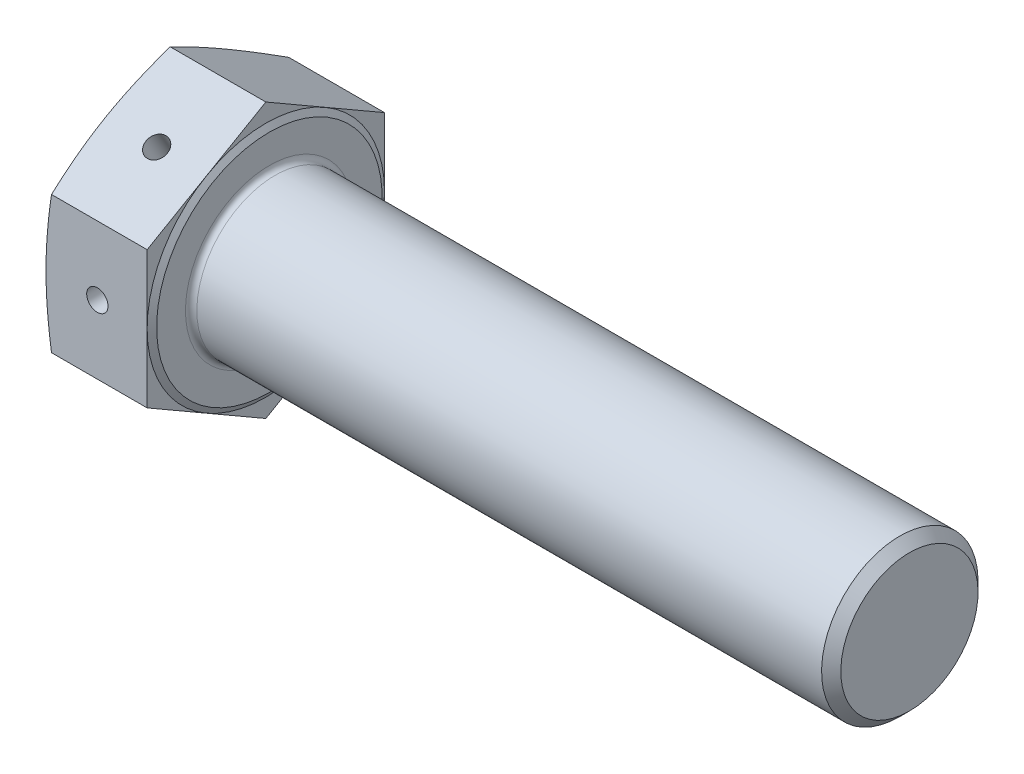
ISO-10303-21;
HEADER;
FILE_DESCRIPTION(('STEP AP214'),'2;1');
FILE_NAME('part.step','',(''),(''),'','','');
FILE_SCHEMA(('AUTOMOTIVE_DESIGN { 1 0 10303 214 1 1 1 1 }'));
ENDSEC;
DATA;
#1=APPLICATION_CONTEXT('core data for automotive mechanical design processes');
#2=APPLICATION_PROTOCOL_DEFINITION('international standard','automotive_design',2000,#1);
#3=PRODUCT_CONTEXT('',#1,'mechanical');
#4=PRODUCT('Part','Part','',(#3));
#5=PRODUCT_RELATED_PRODUCT_CATEGORY('part','',(#4));
#6=PRODUCT_DEFINITION_FORMATION('','',#4);
#7=PRODUCT_DEFINITION_CONTEXT('part definition',#1,'design');
#8=PRODUCT_DEFINITION('design','',#6,#7);
#9=PRODUCT_DEFINITION_SHAPE('','',#8);
#10=(LENGTH_UNIT() NAMED_UNIT(*) SI_UNIT(.MILLI.,.METRE.));
#11=(NAMED_UNIT(*) PLANE_ANGLE_UNIT() SI_UNIT($,.RADIAN.));
#12=(NAMED_UNIT(*) SI_UNIT($,.STERADIAN.) SOLID_ANGLE_UNIT());
#13=UNCERTAINTY_MEASURE_WITH_UNIT(LENGTH_MEASURE(1.E-05),#10,'distance_accuracy_value','');
#14=(GEOMETRIC_REPRESENTATION_CONTEXT(3) GLOBAL_UNCERTAINTY_ASSIGNED_CONTEXT((#13)) GLOBAL_UNIT_ASSIGNED_CONTEXT((#10,
#11,#12)) REPRESENTATION_CONTEXT('',''));
#15=CARTESIAN_POINT('',(0.,0.,0.));
#16=DIRECTION('',(0.,0.,1.));
#17=DIRECTION('',(1.,0.,0.));
#18=AXIS2_PLACEMENT_3D('',#15,#16,#17);
#19=CARTESIAN_POINT('',(7.22,0.,-16.69));
#20=DIRECTION('',(0.,0.,1.));
#21=DIRECTION('',(1.,0.,0.));
#22=AXIS2_PLACEMENT_3D('',#19,#20,#21);
#23=CYLINDRICAL_SURFACE('',#22,1.5);
#24=CARTESIAN_POINT('',(7.22,0.,16.69));
#25=DIRECTION('',(0.,0.,1.));
#26=DIRECTION('',(1.,0.,0.));
#27=AXIS2_PLACEMENT_3D('',#24,#25,#26);
#28=CIRCLE('',#27,1.5);
#29=CARTESIAN_POINT('',(8.72,0.,16.69));
#30=VERTEX_POINT('',#29);
#31=EDGE_CURVE('E584',#30,#30,#28,.T.);
#32=ORIENTED_EDGE('',*,*,#31,.T.);
#33=EDGE_LOOP('',(#32));
#34=FACE_BOUND('',#33,.T.);
#35=CARTESIAN_POINT('',(7.22,0.,0.));
#36=DIRECTION('',(0.,-0.866025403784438,0.500000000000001));
#37=DIRECTION('',(0.,0.500000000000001,0.866025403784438));
#38=AXIS2_PLACEMENT_3D('',#35,#36,#37);
#39=ELLIPSE('',#38,2.99999999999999,1.5);
#40=CARTESIAN_POINT('',(5.72,0.,0.));
#41=VERTEX_POINT('',#40);
#42=CARTESIAN_POINT('',(8.72,0.,0.));
#43=VERTEX_POINT('',#42);
#44=EDGE_CURVE('E46',#41,#43,#39,.F.);
#45=ORIENTED_EDGE('',*,*,#44,.T.);
#46=CARTESIAN_POINT('',(7.22,0.,0.));
#47=DIRECTION('',(0.,0.500000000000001,0.866025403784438));
#48=DIRECTION('',(0.,-0.866025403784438,0.500000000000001));
#49=AXIS2_PLACEMENT_3D('',#46,#47,#48);
#50=ELLIPSE('',#49,1.73205080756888,1.5);
#51=EDGE_CURVE('E11',#43,#41,#50,.F.);
#52=ORIENTED_EDGE('',*,*,#51,.T.);
#53=EDGE_LOOP('',(#45,#52));
#54=FACE_BOUND('',#53,.T.);
#55=ADVANCED_FACE('F32',(#34,#54),#23,.F.);
#56=CARTESIAN_POINT('',(14.72,0.,0.));
#57=DIRECTION('',(-1.,0.,0.));
#58=DIRECTION('',(0.,-1.,0.));
#59=AXIS2_PLACEMENT_3D('',#56,#57,#58);
#60=PLANE('',#59);
#61=CARTESIAN_POINT('',(14.72,0.,0.));
#62=DIRECTION('',(-1.,0.,0.));
#63=DIRECTION('',(0.,-1.,0.));
#64=AXIS2_PLACEMENT_3D('',#61,#62,#63);
#65=CIRCLE('',#64,11.8);
#66=CARTESIAN_POINT('',(14.72,-11.8,0.));
#67=VERTEX_POINT('',#66);
#68=EDGE_CURVE('E137',#67,#67,#65,.T.);
#69=ORIENTED_EDGE('',*,*,#68,.T.);
#70=EDGE_LOOP('',(#69));
#71=FACE_BOUND('',#70,.T.);
#72=CARTESIAN_POINT('',(14.72,0.,0.));
#73=DIRECTION('',(-1.,0.,0.));
#74=DIRECTION('',(0.,-1.,0.));
#75=AXIS2_PLACEMENT_3D('',#72,#73,#74);
#76=CIRCLE('',#75,15.855);
#77=CARTESIAN_POINT('',(14.72,-15.855,0.));
#78=VERTEX_POINT('',#77);
#79=EDGE_CURVE('E286',#78,#78,#76,.T.);
#80=ORIENTED_EDGE('',*,*,#79,.F.);
#81=EDGE_LOOP('',(#80));
#82=FACE_BOUND('',#81,.T.);
#83=ADVANCED_FACE('F240',(#71,#82),#60,.F.);
#84=CARTESIAN_POINT('',(14.22,0.,33.38));
#85=DIRECTION('',(-1.,0.,0.));
#86=DIRECTION('',(0.,0.,1.));
#87=AXIS2_PLACEMENT_3D('',#84,#85,#86);
#88=PLANE('',#87);
#89=DIRECTION('',(0.,-0.5,-0.866025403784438));
#90=VECTOR('',#89,1.);
#91=CARTESIAN_POINT('',(14.22,-9.63597599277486,16.69));
#92=LINE('',#91,#90);
#93=CARTESIAN_POINT('',(14.22,-9.63597599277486,16.69));
#94=VERTEX_POINT('',#93);
#95=CARTESIAN_POINT('',(14.22,-14.4539639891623,8.34500000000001));
#96=VERTEX_POINT('',#95);
#97=EDGE_CURVE('E198',#94,#96,#92,.T.);
#98=ORIENTED_EDGE('',*,*,#97,.T.);
#99=CARTESIAN_POINT('',(14.22,0.,0.));
#100=DIRECTION('',(-1.,0.,0.));
#101=DIRECTION('',(0.,-1.,0.));
#102=AXIS2_PLACEMENT_3D('',#99,#100,#101);
#103=CIRCLE('',#102,16.69);
#104=CARTESIAN_POINT('',(14.22,0.,16.69));
#105=VERTEX_POINT('',#104);
#106=EDGE_CURVE('E54',#96,#105,#103,.T.);
#107=ORIENTED_EDGE('',*,*,#106,.T.);
#108=DIRECTION('',(0.,-1.,0.));
#109=VECTOR('',#108,1.);
#110=CARTESIAN_POINT('',(14.22,9.63597599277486,16.69));
#111=LINE('',#110,#109);
#112=EDGE_CURVE('E181',#105,#94,#111,.T.);
#113=ORIENTED_EDGE('',*,*,#112,.T.);
#114=EDGE_LOOP('',(#98,#107,#113));
#115=FACE_BOUND('',#114,.T.);
#116=ADVANCED_FACE('F246',(#115),#88,.F.);
#117=CARTESIAN_POINT('',(14.22,9.63597599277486,16.69));
#118=VERTEX_POINT('',#117);
#119=EDGE_CURVE('E178',#118,#105,#111,.T.);
#120=ORIENTED_EDGE('',*,*,#119,.T.);
#121=CARTESIAN_POINT('',(14.22,14.4539639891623,8.345));
#122=VERTEX_POINT('',#121);
#123=EDGE_CURVE('E153',#105,#122,#103,.T.);
#124=ORIENTED_EDGE('',*,*,#123,.T.);
#125=DIRECTION('',(0.,-0.5,0.866025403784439));
#126=VECTOR('',#125,1.);
#127=CARTESIAN_POINT('',(14.22,19.2719519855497,0.));
#128=LINE('',#127,#126);
#129=EDGE_CURVE('E185',#122,#118,#128,.T.);
#130=ORIENTED_EDGE('',*,*,#129,.T.);
#131=EDGE_LOOP('',(#120,#124,#130));
#132=FACE_BOUND('',#131,.T.);
#133=ADVANCED_FACE('F342',(#132),#88,.F.);
#134=CARTESIAN_POINT('',(14.22,19.2719519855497,0.));
#135=VERTEX_POINT('',#134);
#136=EDGE_CURVE('E182',#135,#122,#128,.T.);
#137=ORIENTED_EDGE('',*,*,#136,.T.);
#138=CARTESIAN_POINT('',(14.22,14.4539639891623,-8.345));
#139=VERTEX_POINT('',#138);
#140=EDGE_CURVE('E347',#122,#139,#103,.T.);
#141=ORIENTED_EDGE('',*,*,#140,.T.);
#142=DIRECTION('',(0.,0.5,0.866025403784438));
#143=VECTOR('',#142,1.);
#144=CARTESIAN_POINT('',(14.22,9.63597599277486,-16.69));
#145=LINE('',#144,#143);
#146=EDGE_CURVE('E189',#139,#135,#145,.T.);
#147=ORIENTED_EDGE('',*,*,#146,.T.);
#148=EDGE_LOOP('',(#137,#141,#147));
#149=FACE_BOUND('',#148,.T.);
#150=ADVANCED_FACE('F346',(#149),#88,.F.);
#151=CARTESIAN_POINT('',(14.22,9.63597599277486,-16.69));
#152=VERTEX_POINT('',#151);
#153=EDGE_CURVE('E186',#152,#139,#145,.T.);
#154=ORIENTED_EDGE('',*,*,#153,.T.);
#155=CARTESIAN_POINT('',(14.22,0.,-16.69));
#156=VERTEX_POINT('',#155);
#157=EDGE_CURVE('E418',#139,#156,#103,.T.);
#158=ORIENTED_EDGE('',*,*,#157,.T.);
#159=DIRECTION('',(0.,1.,0.));
#160=VECTOR('',#159,1.);
#161=CARTESIAN_POINT('',(14.22,-9.63597599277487,-16.69));
#162=LINE('',#161,#160);
#163=EDGE_CURVE('E193',#156,#152,#162,.T.);
#164=ORIENTED_EDGE('',*,*,#163,.T.);
#165=EDGE_LOOP('',(#154,#158,#164));
#166=FACE_BOUND('',#165,.T.);
#167=ADVANCED_FACE('F405',(#166),#88,.F.);
#168=CARTESIAN_POINT('',(14.22,-9.63597599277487,-16.69));
#169=VERTEX_POINT('',#168);
#170=EDGE_CURVE('E190',#169,#156,#162,.T.);
#171=ORIENTED_EDGE('',*,*,#170,.T.);
#172=CARTESIAN_POINT('',(14.22,-14.4539639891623,-8.345));
#173=VERTEX_POINT('',#172);
#174=EDGE_CURVE('E413',#156,#173,#103,.T.);
#175=ORIENTED_EDGE('',*,*,#174,.T.);
#176=DIRECTION('',(0.,0.5,-0.866025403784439));
#177=VECTOR('',#176,1.);
#178=CARTESIAN_POINT('',(14.22,-19.2719519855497,0.));
#179=LINE('',#178,#177);
#180=EDGE_CURVE('E197',#173,#169,#179,.T.);
#181=ORIENTED_EDGE('',*,*,#180,.T.);
#182=EDGE_LOOP('',(#171,#175,#181));
#183=FACE_BOUND('',#182,.T.);
#184=ADVANCED_FACE('F235',(#183),#88,.F.);
#185=CARTESIAN_POINT('',(14.22,-9.63597599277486,16.69));
#186=DIRECTION('',(0.,0.866025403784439,-0.5));
#187=DIRECTION('',(0.,0.5,0.866025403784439));
#188=AXIS2_PLACEMENT_3D('',#185,#186,#187);
#189=PLANE('',#188);
#190=CARTESIAN_POINT('',(0.774166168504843,-19.2720674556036,-0.000199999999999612));
#191=CARTESIAN_POINT('',(0.71422314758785,-19.0721331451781,0.346096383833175));
#192=CARTESIAN_POINT('',(0.657011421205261,-18.8719946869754,0.692746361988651));
#193=CARTESIAN_POINT('',(0.548625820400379,-18.471297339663,1.38677452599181));
#194=CARTESIAN_POINT('',(0.497452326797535,-18.2707384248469,1.73415275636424));
#195=CARTESIAN_POINT('',(0.353819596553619,-17.6682682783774,2.77766166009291));
#196=CARTESIAN_POINT('',(0.271303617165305,-17.2657452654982,3.47485196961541));
#197=CARTESIAN_POINT('',(0.137661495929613,-16.4619940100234,4.86698998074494));
#198=CARTESIAN_POINT('',(0.0863363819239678,-16.0607741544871,5.56192315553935));
#199=CARTESIAN_POINT('',(0.0175097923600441,-15.2576907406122,6.95290443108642));
#200=CARTESIAN_POINT('',(0.,-14.8558273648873,7.64895221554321));
#201=CARTESIAN_POINT('',(0.,-14.0521006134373,9.04104778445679));
#202=CARTESIAN_POINT('',(0.0175097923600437,-13.6502372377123,9.73709556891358));
#203=CARTESIAN_POINT('',(0.0863363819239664,-12.8471538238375,11.1280768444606));
#204=CARTESIAN_POINT('',(0.13766149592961,-12.4459339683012,11.8230100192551));
#205=CARTESIAN_POINT('',(0.271303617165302,-11.6421827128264,13.2151480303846));
#206=CARTESIAN_POINT('',(0.353819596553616,-11.2396596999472,13.9123383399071));
#207=CARTESIAN_POINT('',(0.497452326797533,-10.6371895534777,14.9558472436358));
#208=CARTESIAN_POINT('',(0.548625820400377,-10.4366306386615,15.3032254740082));
#209=CARTESIAN_POINT('',(0.657011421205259,-10.0359332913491,15.9972536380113));
#210=CARTESIAN_POINT('',(0.714223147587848,-9.83579483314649,16.3439036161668));
#211=CARTESIAN_POINT('',(0.774166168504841,-9.63586052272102,16.6902));
#212=B_SPLINE_CURVE_WITH_KNOTS('',3,(#190,#191,#192,#193,#194,#195,#196,#197,#198,#199,#200,
#201,#202,#203,#204,#205,#206,#207,#208,#209,#210,#211),.UNSPECIFIED.,.F.,.F.,(4,2,2,2,2,2,2,2,
2,2,4),(0.,1.21299328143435,2.42606302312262,4.85330438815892,7.26489480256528,9.67589201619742,
12.0868892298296,14.4984796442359,16.9257210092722,18.1387907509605,19.3517840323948),.UNSPECIFIED.);
#213=CARTESIAN_POINT('',(0.774131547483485,-19.2719519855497,0.));
#214=VERTEX_POINT('',#213);
#215=CARTESIAN_POINT('',(0.,-14.4539639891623,8.34500000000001));
#216=VERTEX_POINT('',#215);
#217=EDGE_CURVE('E357',#214,#216,#212,.T.);
#218=ORIENTED_EDGE('',*,*,#217,.F.);
#219=DIRECTION('',(-1.,0.,0.));
#220=VECTOR('',#219,1.);
#221=CARTESIAN_POINT('',(14.22,-19.2719519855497,0.));
#222=LINE('',#221,#220);
#223=CARTESIAN_POINT('',(14.22,-19.2719519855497,0.));
#224=VERTEX_POINT('',#223);
#225=EDGE_CURVE('E160',#224,#214,#222,.T.);
#226=ORIENTED_EDGE('',*,*,#225,.F.);
#227=EDGE_CURVE('E201',#96,#224,#92,.T.);
#228=ORIENTED_EDGE('',*,*,#227,.F.);
#229=ORIENTED_EDGE('',*,*,#97,.F.);
#230=DIRECTION('',(-1.,0.,0.));
#231=VECTOR('',#230,1.);
#232=CARTESIAN_POINT('',(14.22,-9.63597599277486,16.69));
#233=LINE('',#232,#231);
#234=CARTESIAN_POINT('',(0.774131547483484,-9.63597599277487,16.69));
#235=VERTEX_POINT('',#234);
#236=EDGE_CURVE('E175',#94,#235,#233,.T.);
#237=ORIENTED_EDGE('',*,*,#236,.T.);
#238=EDGE_CURVE('E334',#216,#235,#212,.T.);
#239=ORIENTED_EDGE('',*,*,#238,.F.);
#240=EDGE_LOOP('',(#218,#226,#228,#229,#237,#239));
#241=FACE_BOUND('',#240,.T.);
#242=ADVANCED_FACE('F34',(#241),#189,.F.);
#243=CARTESIAN_POINT('',(14.22,-19.2719519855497,0.));
#244=DIRECTION('',(0.,0.866025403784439,0.5));
#245=DIRECTION('',(0.,-0.5,0.866025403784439));
#246=AXIS2_PLACEMENT_3D('',#243,#244,#245);
#247=PLANE('',#246);
#248=CARTESIAN_POINT('',(7.22,-14.4539639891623,-8.34499999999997));
#249=DIRECTION('',(0.,0.866025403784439,0.5));
#250=DIRECTION('',(0.,-0.5,0.866025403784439));
#251=AXIS2_PLACEMENT_3D('',#248,#249,#250);
#252=CIRCLE('',#251,1.5);
#253=CARTESIAN_POINT('',(7.22,-15.2039639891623,-7.04596189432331));
#254=VERTEX_POINT('',#253);
#255=EDGE_CURVE('E582',#254,#254,#252,.T.);
#256=ORIENTED_EDGE('',*,*,#255,.T.);
#257=EDGE_LOOP('',(#256));
#258=FACE_BOUND('',#257,.T.);
#259=CARTESIAN_POINT('',(0.774166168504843,-9.63586052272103,-16.6902));
#260=CARTESIAN_POINT('',(0.71422314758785,-9.83579483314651,-16.3439036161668));
#261=CARTESIAN_POINT('',(0.657011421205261,-10.0359332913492,-15.9972536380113));
#262=CARTESIAN_POINT('',(0.548625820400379,-10.4366306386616,-15.3032254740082));
#263=CARTESIAN_POINT('',(0.497452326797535,-10.6371895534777,-14.9558472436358));
#264=CARTESIAN_POINT('',(0.353819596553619,-11.2396596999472,-13.9123383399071));
#265=CARTESIAN_POINT('',(0.271303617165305,-11.6421827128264,-13.2151480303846));
#266=CARTESIAN_POINT('',(0.137661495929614,-12.4459339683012,-11.8230100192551));
#267=CARTESIAN_POINT('',(0.086336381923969,-12.8471538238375,-11.1280768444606));
#268=CARTESIAN_POINT('',(0.0175097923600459,-13.6502372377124,-9.73709556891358));
#269=CARTESIAN_POINT('',(0.,-14.0521006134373,-9.04104778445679));
#270=CARTESIAN_POINT('',(0.,-14.8558273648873,-7.64895221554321));
#271=CARTESIAN_POINT('',(0.0175097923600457,-15.2576907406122,-6.95290443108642));
#272=CARTESIAN_POINT('',(0.0863363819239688,-16.0607741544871,-5.56192315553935));
#273=CARTESIAN_POINT('',(0.137661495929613,-16.4619940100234,-4.86698998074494));
#274=CARTESIAN_POINT('',(0.271303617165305,-17.2657452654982,-3.47485196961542));
#275=CARTESIAN_POINT('',(0.353819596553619,-17.6682682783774,-2.77766166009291));
#276=CARTESIAN_POINT('',(0.497452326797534,-18.2707384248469,-1.73415275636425));
#277=CARTESIAN_POINT('',(0.548625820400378,-18.471297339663,-1.38677452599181));
#278=CARTESIAN_POINT('',(0.65701142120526,-18.8719946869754,-0.692746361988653));
#279=CARTESIAN_POINT('',(0.71422314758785,-19.0721331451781,-0.346096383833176));
#280=CARTESIAN_POINT('',(0.774166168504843,-19.2720674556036,0.000199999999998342));
#281=B_SPLINE_CURVE_WITH_KNOTS('',3,(#259,#260,#261,#262,#263,#264,#265,#266,#267,#268,#269,
#270,#271,#272,#273,#274,#275,#276,#277,#278,#279,#280),.UNSPECIFIED.,.F.,.F.,(4,2,2,2,2,2,2,2,
2,2,4),(0.,1.21299328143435,2.42606302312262,4.85330438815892,7.26489480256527,9.67589201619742,
12.0868892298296,14.4984796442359,16.9257210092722,18.1387907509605,19.3517840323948),.UNSPECIFIED.);
#282=CARTESIAN_POINT('',(0.774131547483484,-9.63597599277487,-16.69));
#283=VERTEX_POINT('',#282);
#284=CARTESIAN_POINT('',(0.,-14.4539639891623,-8.34499999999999));
#285=VERTEX_POINT('',#284);
#286=EDGE_CURVE('E356',#283,#285,#281,.T.);
#287=ORIENTED_EDGE('',*,*,#286,.F.);
#288=DIRECTION('',(-1.,0.,0.));
#289=VECTOR('',#288,1.);
#290=CARTESIAN_POINT('',(14.22,-9.63597599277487,-16.69));
#291=LINE('',#290,#289);
#292=EDGE_CURVE('E163',#169,#283,#291,.T.);
#293=ORIENTED_EDGE('',*,*,#292,.F.);
#294=ORIENTED_EDGE('',*,*,#180,.F.);
#295=EDGE_CURVE('E194',#224,#173,#179,.T.);
#296=ORIENTED_EDGE('',*,*,#295,.F.);
#297=ORIENTED_EDGE('',*,*,#225,.T.);
#298=EDGE_CURVE('E211',#285,#214,#281,.T.);
#299=ORIENTED_EDGE('',*,*,#298,.F.);
#300=EDGE_LOOP('',(#287,#293,#294,#296,#297,#299));
#301=FACE_BOUND('',#300,.T.);
#302=ADVANCED_FACE('F225',(#258,#301),#247,.F.);
#303=CARTESIAN_POINT('',(14.22,-9.63597599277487,-16.69));
#304=DIRECTION('',(0.,0.,1.));
#305=DIRECTION('',(0.,-1.,0.));
#306=AXIS2_PLACEMENT_3D('',#303,#304,#305);
#307=PLANE('',#306);
#308=CARTESIAN_POINT('',(7.22,0.,-16.69));
#309=DIRECTION('',(0.,0.,1.));
#310=DIRECTION('',(1.,0.,0.));
#311=AXIS2_PLACEMENT_3D('',#308,#309,#310);
#312=CIRCLE('',#311,1.5);
#313=CARTESIAN_POINT('',(8.72,0.,-16.69));
#314=VERTEX_POINT('',#313);
#315=EDGE_CURVE('E292',#314,#314,#312,.T.);
#316=ORIENTED_EDGE('',*,*,#315,.T.);
#317=EDGE_LOOP('',(#316));
#318=FACE_BOUND('',#317,.T.);
#319=CARTESIAN_POINT('',(4.13056238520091,-25.4884021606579,-16.69));
#320=CARTESIAN_POINT('',(4.03565085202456,-25.1100094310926,-16.69));
#321=CARTESIAN_POINT('',(3.94133217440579,-24.7314680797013,-16.69));
#322=CARTESIAN_POINT('',(3.75401163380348,-23.9740581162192,-16.69));
#323=CARTESIAN_POINT('',(3.66100977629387,-23.5951895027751,-16.69));
#324=CARTESIAN_POINT('',(3.3841680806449,-22.4580147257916,-16.69));
#325=CARTESIAN_POINT('',(3.20250159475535,-21.6991772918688,-16.69));
#326=CARTESIAN_POINT('',(2.84605698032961,-20.1788961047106,-16.69));
#327=CARTESIAN_POINT('',(2.67128761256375,-19.4174502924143,-16.69));
#328=CARTESIAN_POINT('',(2.33055763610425,-17.8925908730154,-16.69));
#329=CARTESIAN_POINT('',(2.16459693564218,-17.1291772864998,-16.69));
#330=CARTESIAN_POINT('',(1.8452376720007,-15.6077732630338,-16.69));
#331=CARTESIAN_POINT('',(1.69172905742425,-14.8498060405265,-16.69));
#332=CARTESIAN_POINT('',(1.39802253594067,-13.3312764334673,-16.69));
#333=CARTESIAN_POINT('',(1.25782468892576,-12.5707140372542,-16.69));
#334=CARTESIAN_POINT('',(0.993931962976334,-11.0468385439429,-16.69));
#335=CARTESIAN_POINT('',(0.870234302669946,-10.2835259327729,-16.69));
#336=CARTESIAN_POINT('',(0.643026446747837,-8.75386639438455,-16.69));
#337=CARTESIAN_POINT('',(0.539516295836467,-7.98751946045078,-16.69));
#338=CARTESIAN_POINT('',(0.355400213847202,-6.44074134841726,-16.69));
#339=CARTESIAN_POINT('',(0.275148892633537,-5.66026730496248,-16.69));
#340=CARTESIAN_POINT('',(0.143645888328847,-4.09685903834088,-16.69));
#341=CARTESIAN_POINT('',(0.0923933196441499,-3.31392489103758,-16.69));
#342=CARTESIAN_POINT('',(0.0219847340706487,-1.74704230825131,-16.69));
#343=CARTESIAN_POINT('',(0.00280999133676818,-0.963094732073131,-16.69));
#344=CARTESIAN_POINT('',(-0.00223381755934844,0.604909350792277,-16.69));
#345=CARTESIAN_POINT('',(0.0118970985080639,1.38896585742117,-16.69));
#346=CARTESIAN_POINT('',(0.0726630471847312,2.95937250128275,-16.69));
#347=CARTESIAN_POINT('',(0.119445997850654,3.74571679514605,-16.69));
#348=CARTESIAN_POINT('',(0.242785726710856,5.31604528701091,-16.69));
#349=CARTESIAN_POINT('',(0.31934338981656,6.10002941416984,-16.69));
#350=CARTESIAN_POINT('',(0.498291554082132,7.66567227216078,-16.69));
#351=CARTESIAN_POINT('',(0.600703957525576,8.44732846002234,-16.69));
#352=CARTESIAN_POINT('',(0.827028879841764,10.0074865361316,-16.69));
#353=CARTESIAN_POINT('',(0.950941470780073,10.7859884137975,-16.69));
#354=CARTESIAN_POINT('',(1.2066804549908,12.2837572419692,-16.69));
#355=CARTESIAN_POINT('',(1.33728570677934,13.0032348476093,-16.69));
#356=CARTESIAN_POINT('',(1.61082994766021,14.4398529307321,-16.69));
#357=CARTESIAN_POINT('',(1.75376934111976,15.1569933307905,-16.69));
#358=CARTESIAN_POINT('',(2.04971358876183,16.5892737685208,-16.69));
#359=CARTESIAN_POINT('',(2.20271964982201,17.3044135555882,-16.69));
#360=CARTESIAN_POINT('',(2.51692809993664,18.73287560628,-16.69));
#361=CARTESIAN_POINT('',(2.67813039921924,19.4461978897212,-16.69));
#362=CARTESIAN_POINT('',(3.00728624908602,20.871457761,-16.69));
#363=CARTESIAN_POINT('',(3.1752413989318,21.5833949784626,-16.69));
#364=CARTESIAN_POINT('',(3.5166808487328,23.0059408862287,-16.69));
#365=CARTESIAN_POINT('',(3.69016515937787,23.716549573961,-16.69));
#366=CARTESIAN_POINT('',(4.0417002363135,25.1365767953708,-16.69));
#367=CARTESIAN_POINT('',(4.21975065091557,25.8459954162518,-16.69));
#368=CARTESIAN_POINT('',(4.57967808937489,27.2638621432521,-16.69));
#369=CARTESIAN_POINT('',(4.76155512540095,27.9723102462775,-16.69));
#370=CARTESIAN_POINT('',(5.30745768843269,30.0789597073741,-16.69));
#371=CARTESIAN_POINT('',(5.67612060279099,31.4759592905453,-16.69));
#372=CARTESIAN_POINT('',(6.42244236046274,34.2675762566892,-16.69));
#373=CARTESIAN_POINT('',(6.80010140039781,35.6621935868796,-16.69));
#374=CARTESIAN_POINT('',(7.56156532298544,38.4476093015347,-16.69));
#375=CARTESIAN_POINT('',(7.94536066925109,39.8384102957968,-16.69));
#376=CARTESIAN_POINT('',(8.52485130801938,41.9235251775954,-16.69));
#377=CARTESIAN_POINT('',(8.71864402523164,42.6183690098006,-16.69));
#378=CARTESIAN_POINT('',(9.10735243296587,44.0077415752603,-16.69));
#379=CARTESIAN_POINT('',(9.30226812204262,44.7022703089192,-16.69));
#380=CARTESIAN_POINT('',(9.49767290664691,45.3966614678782,-16.69));
#381=B_SPLINE_CURVE_WITH_KNOTS('',3,(#319,#320,#321,#322,#323,#324,#325,#326,#327,#328,#329,
#330,#331,#332,#333,#334,#335,#336,#337,#338,#339,#340,#341,#342,#343,#344,#345,#346,#347,#348,
#349,#350,#351,#352,#353,#354,#355,#356,#357,#358,#359,#360,#361,#362,#363,#364,#365,#366,#367,
#368,#369,#370,#371,#372,#373,#374,#375,#376,#377,#378,#379,#380),.UNSPECIFIED.,.F.,.F.,(4,2,2,
2,2,2,2,2,2,2,2,2,2,2,2,2,2,2,2,2,2,2,2,2,2,2,2,2,2,2,4),(0.,1.17034234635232,2.34068955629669,
4.68150049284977,7.02519485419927,9.36886479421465,11.6888373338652,14.0088203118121,
16.3284117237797,18.648008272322,21.0013048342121,23.3545295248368,25.7063800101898,
28.0582292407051,30.4208024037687,32.7834457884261,35.1480973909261,37.5127569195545,
39.70633748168,41.8999899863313,44.0939059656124,46.2877979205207,48.4822125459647,
50.6766314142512,52.8708817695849,55.0651391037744,59.3995670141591,63.7340897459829,
68.062428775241,70.2265150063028,72.3905984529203),.UNSPECIFIED.);
#382=CARTESIAN_POINT('',(0.774131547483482,9.63597599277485,-16.69));
#383=VERTEX_POINT('',#382);
#384=CARTESIAN_POINT('',(0.,0.,-16.69));
#385=VERTEX_POINT('',#384);
#386=EDGE_CURVE('E209',#383,#385,#381,.F.);
#387=ORIENTED_EDGE('',*,*,#386,.F.);
#388=DIRECTION('',(-1.,0.,0.));
#389=VECTOR('',#388,1.);
#390=CARTESIAN_POINT('',(14.22,9.63597599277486,-16.69));
#391=LINE('',#390,#389);
#392=EDGE_CURVE('E166',#152,#383,#391,.T.);
#393=ORIENTED_EDGE('',*,*,#392,.F.);
#394=ORIENTED_EDGE('',*,*,#163,.F.);
#395=ORIENTED_EDGE('',*,*,#170,.F.);
#396=ORIENTED_EDGE('',*,*,#292,.T.);
#397=EDGE_CURVE('E202',#385,#283,#381,.F.);
#398=ORIENTED_EDGE('',*,*,#397,.F.);
#399=EDGE_LOOP('',(#387,#393,#394,#395,#396,#398));
#400=FACE_BOUND('',#399,.T.);
#401=ADVANCED_FACE('F220',(#318,#400),#307,.F.);
#402=CARTESIAN_POINT('',(14.22,9.63597599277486,-16.69));
#403=DIRECTION('',(0.,-0.866025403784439,0.5));
#404=DIRECTION('',(0.,-0.5,-0.866025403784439));
#405=AXIS2_PLACEMENT_3D('',#402,#403,#404);
#406=PLANE('',#405);
#407=CARTESIAN_POINT('',(0.774166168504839,19.2720674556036,0.000199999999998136));
#408=CARTESIAN_POINT('',(0.714223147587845,19.0721331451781,-0.346096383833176));
#409=CARTESIAN_POINT('',(0.657011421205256,18.8719946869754,-0.692746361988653));
#410=CARTESIAN_POINT('',(0.548625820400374,18.471297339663,-1.38677452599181));
#411=CARTESIAN_POINT('',(0.49745232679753,18.2707384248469,-1.73415275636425));
#412=CARTESIAN_POINT('',(0.353819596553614,17.6682682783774,-2.77766166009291));
#413=CARTESIAN_POINT('',(0.271303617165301,17.2657452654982,-3.47485196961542));
#414=CARTESIAN_POINT('',(0.137661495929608,16.4619940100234,-4.86698998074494));
#415=CARTESIAN_POINT('',(0.0863363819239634,16.0607741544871,-5.56192315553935));
#416=CARTESIAN_POINT('',(0.0175097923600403,15.2576907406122,-6.95290443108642));
#417=CARTESIAN_POINT('',(0.,14.8558273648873,-7.64895221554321));
#418=CARTESIAN_POINT('',(0.,14.0521006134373,-9.04104778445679));
#419=CARTESIAN_POINT('',(0.0175097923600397,13.6502372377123,-9.73709556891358));
#420=CARTESIAN_POINT('',(0.0863363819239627,12.8471538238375,-11.1280768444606));
#421=CARTESIAN_POINT('',(0.137661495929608,12.4459339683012,-11.8230100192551));
#422=CARTESIAN_POINT('',(0.271303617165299,11.6421827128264,-13.2151480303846));
#423=CARTESIAN_POINT('',(0.353819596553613,11.2396596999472,-13.9123383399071));
#424=CARTESIAN_POINT('',(0.497452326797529,10.6371895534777,-14.9558472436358));
#425=CARTESIAN_POINT('',(0.548625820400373,10.4366306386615,-15.3032254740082));
#426=CARTESIAN_POINT('',(0.657011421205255,10.0359332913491,-15.9972536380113));
#427=CARTESIAN_POINT('',(0.714223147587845,9.83579483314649,-16.3439036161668));
#428=CARTESIAN_POINT('',(0.774166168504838,9.63586052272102,-16.6902));
#429=B_SPLINE_CURVE_WITH_KNOTS('',3,(#407,#408,#409,#410,#411,#412,#413,#414,#415,#416,#417,
#418,#419,#420,#421,#422,#423,#424,#425,#426,#427,#428),.UNSPECIFIED.,.F.,.F.,(4,2,2,2,2,2,2,2,
2,2,4),(0.,1.21299328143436,2.42606302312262,4.85330438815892,7.26489480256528,9.67589201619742,
12.0868892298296,14.4984796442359,16.9257210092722,18.1387907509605,19.3517840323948),.UNSPECIFIED.);
#430=CARTESIAN_POINT('',(0.774131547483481,19.2719519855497,0.));
#431=VERTEX_POINT('',#430);
#432=CARTESIAN_POINT('',(0.,14.4539639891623,-8.345));
#433=VERTEX_POINT('',#432);
#434=EDGE_CURVE('E353',#431,#433,#429,.T.);
#435=ORIENTED_EDGE('',*,*,#434,.F.);
#436=DIRECTION('',(-1.,0.,0.));
#437=VECTOR('',#436,1.);
#438=CARTESIAN_POINT('',(14.22,19.2719519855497,0.));
#439=LINE('',#438,#437);
#440=EDGE_CURVE('E169',#135,#431,#439,.T.);
#441=ORIENTED_EDGE('',*,*,#440,.F.);
#442=ORIENTED_EDGE('',*,*,#146,.F.);
#443=ORIENTED_EDGE('',*,*,#153,.F.);
#444=ORIENTED_EDGE('',*,*,#392,.T.);
#445=EDGE_CURVE('E210',#433,#383,#429,.T.);
#446=ORIENTED_EDGE('',*,*,#445,.F.);
#447=EDGE_LOOP('',(#435,#441,#442,#443,#444,#446));
#448=FACE_BOUND('',#447,.T.);
#449=ADVANCED_FACE('F224',(#448),#406,.F.);
#450=CARTESIAN_POINT('',(14.22,19.2719519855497,0.));
#451=DIRECTION('',(0.,-0.866025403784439,-0.5));
#452=DIRECTION('',(0.,0.5,-0.866025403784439));
#453=AXIS2_PLACEMENT_3D('',#450,#451,#452);
#454=PLANE('',#453);
#455=CARTESIAN_POINT('',(7.22,14.4539639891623,8.34499999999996));
#456=DIRECTION('',(0.,-0.866025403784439,-0.5));
#457=DIRECTION('',(0.,0.5,-0.866025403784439));
#458=AXIS2_PLACEMENT_3D('',#455,#456,#457);
#459=CIRCLE('',#458,1.5);
#460=CARTESIAN_POINT('',(7.22,15.2039639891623,7.04596189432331));
#461=VERTEX_POINT('',#460);
#462=EDGE_CURVE('E324',#461,#461,#459,.T.);
#463=ORIENTED_EDGE('',*,*,#462,.T.);
#464=EDGE_LOOP('',(#463));
#465=FACE_BOUND('',#464,.T.);
#466=CARTESIAN_POINT('',(0.774166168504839,9.63586052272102,16.6902));
#467=CARTESIAN_POINT('',(0.714223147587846,9.8357948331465,16.3439036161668));
#468=CARTESIAN_POINT('',(0.657011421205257,10.0359332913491,15.9972536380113));
#469=CARTESIAN_POINT('',(0.548625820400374,10.4366306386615,15.3032254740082));
#470=CARTESIAN_POINT('',(0.49745232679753,10.6371895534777,14.9558472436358));
#471=CARTESIAN_POINT('',(0.353819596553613,11.2396596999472,13.9123383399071));
#472=CARTESIAN_POINT('',(0.2713036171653,11.6421827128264,13.2151480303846));
#473=CARTESIAN_POINT('',(0.137661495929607,12.4459339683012,11.8230100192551));
#474=CARTESIAN_POINT('',(0.086336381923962,12.8471538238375,11.1280768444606));
#475=CARTESIAN_POINT('',(0.0175097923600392,13.6502372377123,9.73709556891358));
#476=CARTESIAN_POINT('',(0.,14.0521006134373,9.04104778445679));
#477=CARTESIAN_POINT('',(0.,14.8558273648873,7.64895221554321));
#478=CARTESIAN_POINT('',(0.0175097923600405,15.2576907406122,6.95290443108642));
#479=CARTESIAN_POINT('',(0.0863363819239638,16.0607741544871,5.56192315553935));
#480=CARTESIAN_POINT('',(0.137661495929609,16.4619940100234,4.86698998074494));
#481=CARTESIAN_POINT('',(0.271303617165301,17.2657452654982,3.47485196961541));
#482=CARTESIAN_POINT('',(0.353819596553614,17.6682682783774,2.7776616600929));
#483=CARTESIAN_POINT('',(0.497452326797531,18.2707384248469,1.73415275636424));
#484=CARTESIAN_POINT('',(0.548625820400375,18.471297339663,1.3867745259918));
#485=CARTESIAN_POINT('',(0.657011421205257,18.8719946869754,0.692746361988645));
#486=CARTESIAN_POINT('',(0.714223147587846,19.0721331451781,0.346096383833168));
#487=CARTESIAN_POINT('',(0.774166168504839,19.2720674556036,-0.00020000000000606));
#488=B_SPLINE_CURVE_WITH_KNOTS('',3,(#466,#467,#468,#469,#470,#471,#472,#473,#474,#475,#476,
#477,#478,#479,#480,#481,#482,#483,#484,#485,#486,#487),.UNSPECIFIED.,.F.,.F.,(4,2,2,2,2,2,2,2,
2,2,4),(0.,1.21299328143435,2.42606302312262,4.85330438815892,7.26489480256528,9.67589201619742,
12.0868892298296,14.4984796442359,16.9257210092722,18.1387907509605,19.3517840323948),.UNSPECIFIED.);
#489=CARTESIAN_POINT('',(0.774131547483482,9.63597599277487,16.69));
#490=VERTEX_POINT('',#489);
#491=CARTESIAN_POINT('',(0.,14.4539639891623,8.34500000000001));
#492=VERTEX_POINT('',#491);
#493=EDGE_CURVE('E302',#490,#492,#488,.T.);
#494=ORIENTED_EDGE('',*,*,#493,.F.);
#495=DIRECTION('',(-1.,0.,0.));
#496=VECTOR('',#495,1.);
#497=CARTESIAN_POINT('',(14.22,9.63597599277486,16.69));
#498=LINE('',#497,#496);
#499=EDGE_CURVE('E172',#118,#490,#498,.T.);
#500=ORIENTED_EDGE('',*,*,#499,.F.);
#501=ORIENTED_EDGE('',*,*,#129,.F.);
#502=ORIENTED_EDGE('',*,*,#136,.F.);
#503=ORIENTED_EDGE('',*,*,#440,.T.);
#504=EDGE_CURVE('E330',#492,#431,#488,.T.);
#505=ORIENTED_EDGE('',*,*,#504,.F.);
#506=EDGE_LOOP('',(#494,#500,#501,#502,#503,#505));
#507=FACE_BOUND('',#506,.T.);
#508=ADVANCED_FACE('F312',(#465,#507),#454,.F.);
#509=CARTESIAN_POINT('',(14.22,9.63597599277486,16.69));
#510=DIRECTION('',(0.,0.,-1.));
#511=DIRECTION('',(0.,1.,0.));
#512=AXIS2_PLACEMENT_3D('',#509,#510,#511);
#513=PLANE('',#512);
#514=ORIENTED_EDGE('',*,*,#31,.F.);
#515=EDGE_LOOP('',(#514));
#516=FACE_BOUND('',#515,.T.);
#517=CARTESIAN_POINT('',(4.13056185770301,-25.4884000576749,16.69));
#518=CARTESIAN_POINT('',(4.03565033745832,-25.110007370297,16.69));
#519=CARTESIAN_POINT('',(3.94133167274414,-24.7314660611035,16.69));
#520=CARTESIAN_POINT('',(3.75401115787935,-23.9740561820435,16.69));
#521=CARTESIAN_POINT('',(3.66100931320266,-23.5951876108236,16.69));
#522=CARTESIAN_POINT('',(3.38416765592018,-22.4580129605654,16.69));
#523=CARTESIAN_POINT('',(3.20250119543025,-21.6991756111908,16.69));
#524=CARTESIAN_POINT('',(2.84605663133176,-20.1788945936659,16.69));
#525=CARTESIAN_POINT('',(2.6712872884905,-19.4174488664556,16.69));
#526=CARTESIAN_POINT('',(2.3305573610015,-17.8925896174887,16.69));
#527=CARTESIAN_POINT('',(2.16459668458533,-17.1291761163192,16.69));
#528=CARTESIAN_POINT('',(1.84523746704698,-15.607772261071,16.69));
#529=CARTESIAN_POINT('',(1.69172887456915,-14.8498051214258,16.69));
#530=CARTESIAN_POINT('',(1.3980223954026,-13.3312756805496,16.69));
#531=CARTESIAN_POINT('',(1.25782456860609,-12.5707133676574,16.69));
#532=CARTESIAN_POINT('',(0.993931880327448,-11.0468380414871,16.69));
#533=CARTESIAN_POINT('',(0.870234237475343,-10.2835255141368,16.69));
#534=CARTESIAN_POINT('',(0.643026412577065,-8.75386614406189,16.69));
#535=CARTESIAN_POINT('',(0.539516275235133,-7.98751929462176,16.69));
#536=CARTESIAN_POINT('',(0.3554002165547,-6.44074136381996,16.69));
#537=CARTESIAN_POINT('',(0.275148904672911,-5.66026741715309,16.69));
#538=CARTESIAN_POINT('',(0.143645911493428,-4.09685934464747,16.69));
#539=CARTESIAN_POINT('',(0.0923933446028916,-3.31392529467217,16.69));
#540=CARTESIAN_POINT('',(0.0219847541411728,-1.74704290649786,16.69));
#541=CARTESIAN_POINT('',(0.00281000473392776,-0.963095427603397,16.69));
#542=CARTESIAN_POINT('',(-0.00223382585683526,0.60490846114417,16.69));
#543=CARTESIAN_POINT('',(0.0118970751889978,1.38896487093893,16.69));
#544=CARTESIAN_POINT('',(0.072662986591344,2.95937132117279,16.69));
#545=CARTESIAN_POINT('',(0.119445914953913,3.74571551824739,16.69));
#546=CARTESIAN_POINT('',(0.242785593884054,5.3160438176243,16.69));
#547=CARTESIAN_POINT('',(0.319343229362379,6.10002784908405,16.69));
#548=CARTESIAN_POINT('',(0.498291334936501,7.66567051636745,16.69));
#549=CARTESIAN_POINT('',(0.600703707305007,8.44732660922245,16.69));
#550=CARTESIAN_POINT('',(0.827028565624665,10.0074844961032,16.69));
#551=CARTESIAN_POINT('',(0.950941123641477,10.7859862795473,16.69));
#552=CARTESIAN_POINT('',(1.20668005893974,12.2837550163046,16.69));
#553=CARTESIAN_POINT('',(1.3372852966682,13.0032326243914,16.69));
#554=CARTESIAN_POINT('',(1.610829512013,14.4398507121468,16.69));
#555=CARTESIAN_POINT('',(1.75376889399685,15.1569911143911,16.69));
#556=CARTESIAN_POINT('',(2.04971312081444,16.5892715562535,16.69));
#557=CARTESIAN_POINT('',(2.20271917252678,17.3044113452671,16.69));
#558=CARTESIAN_POINT('',(2.51692760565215,18.7328733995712,16.69));
#559=CARTESIAN_POINT('',(2.67812989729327,19.4461956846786,16.69));
#560=CARTESIAN_POINT('',(3.00728573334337,20.8714555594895,16.69));
#561=CARTESIAN_POINT('',(3.17524087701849,21.5833927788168,16.69));
#562=CARTESIAN_POINT('',(3.51668031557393,23.005938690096,16.69));
#563=CARTESIAN_POINT('',(3.69016462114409,23.7165473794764,16.69));
#564=CARTESIAN_POINT('',(4.04169968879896,25.1365746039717,16.69));
#565=CARTESIAN_POINT('',(4.21975009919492,25.8459932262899,16.69));
#566=CARTESIAN_POINT('',(4.5796775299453,27.2638599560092,16.69));
#567=CARTESIAN_POINT('',(4.76155456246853,27.9723080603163,16.69));
#568=CARTESIAN_POINT('',(5.30745711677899,30.0789575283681,16.69));
#569=CARTESIAN_POINT('',(5.67612002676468,31.4759571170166,16.69));
#570=CARTESIAN_POINT('',(6.42244177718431,34.26757409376,16.69));
#571=CARTESIAN_POINT('',(6.80010081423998,35.6621914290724,16.69));
#572=CARTESIAN_POINT('',(7.56156473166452,38.4476071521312,16.69));
#573=CARTESIAN_POINT('',(7.94536007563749,39.8384081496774,16.69));
#574=CARTESIAN_POINT('',(8.52485071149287,41.9235230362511,16.69));
#575=CARTESIAN_POINT('',(8.71864342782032,42.6183668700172,16.69));
#576=CARTESIAN_POINT('',(9.10735183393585,44.0077394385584,16.69));
#577=CARTESIAN_POINT('',(9.30226752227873,44.7022681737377,16.69));
#578=CARTESIAN_POINT('',(9.49767230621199,45.3966593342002,16.69));
#579=B_SPLINE_CURVE_WITH_KNOTS('',3,(#517,#518,#519,#520,#521,#522,#523,#524,#525,#526,#527,
#528,#529,#530,#531,#532,#533,#534,#535,#536,#537,#538,#539,#540,#541,#542,#543,#544,#545,#546,
#547,#548,#549,#550,#551,#552,#553,#554,#555,#556,#557,#558,#559,#560,#561,#562,#563,#564,#565,
#566,#567,#568,#569,#570,#571,#572,#573,#574,#575,#576,#577,#578),.UNSPECIFIED.,.F.,.F.,(4,2,2,
2,2,2,2,2,2,2,2,2,2,2,2,2,2,2,2,2,2,2,2,2,2,2,2,2,2,2,4),(0.,1.17034221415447,2.3406892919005,
4.68149996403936,7.02519405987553,9.36886373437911,11.6888360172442,14.0088187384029,
16.3284098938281,18.6480061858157,21.001302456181,23.3545268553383,25.7063770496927,
28.0582259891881,30.4207988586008,32.7834419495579,35.1480932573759,37.5127524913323,
39.7063330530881,41.8999855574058,44.0939015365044,46.2877934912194,48.4822081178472,
50.6766269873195,52.8708773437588,55.0651346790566,59.3995626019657,63.7340853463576,
68.0624243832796,70.2265106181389,72.3905940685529),.UNSPECIFIED.);
#580=CARTESIAN_POINT('',(0.,0.,16.69));
#581=VERTEX_POINT('',#580);
#582=EDGE_CURVE('E301',#235,#581,#579,.T.);
#583=ORIENTED_EDGE('',*,*,#582,.F.);
#584=ORIENTED_EDGE('',*,*,#236,.F.);
#585=ORIENTED_EDGE('',*,*,#112,.F.);
#586=ORIENTED_EDGE('',*,*,#119,.F.);
#587=ORIENTED_EDGE('',*,*,#499,.T.);
#588=EDGE_CURVE('E290',#581,#490,#579,.T.);
#589=ORIENTED_EDGE('',*,*,#588,.F.);
#590=EDGE_LOOP('',(#583,#584,#585,#586,#587,#589));
#591=FACE_BOUND('',#590,.T.);
#592=ADVANCED_FACE('F307',(#516,#591),#513,.F.);
#593=ORIENTED_EDGE('',*,*,#295,.T.);
#594=EDGE_CURVE('E157',#173,#96,#103,.T.);
#595=ORIENTED_EDGE('',*,*,#594,.T.);
#596=ORIENTED_EDGE('',*,*,#227,.T.);
#597=EDGE_LOOP('',(#593,#595,#596));
#598=FACE_BOUND('',#597,.T.);
#599=ADVANCED_FACE('F311',(#598),#88,.F.);
#600=CARTESIAN_POINT('',(0.,0.,0.));
#601=DIRECTION('',(1.,0.,0.));
#602=DIRECTION('',(0.,1.,0.));
#603=AXIS2_PLACEMENT_3D('',#600,#601,#602);
#604=CONICAL_SURFACE('',#603,16.69,1.27950087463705);
#605=ORIENTED_EDGE('',*,*,#238,.T.);
#606=ORIENTED_EDGE('',*,*,#582,.T.);
#607=CARTESIAN_POINT('',(0.,0.,0.));
#608=DIRECTION('',(-1.,0.,0.));
#609=DIRECTION('',(0.,-1.,0.));
#610=AXIS2_PLACEMENT_3D('',#607,#608,#609);
#611=CIRCLE('',#610,16.69);
#612=EDGE_CURVE('E288',#216,#581,#611,.T.);
#613=ORIENTED_EDGE('',*,*,#612,.F.);
#614=EDGE_LOOP('',(#605,#606,#613));
#615=FACE_BOUND('',#614,.T.);
#616=ADVANCED_FACE('F392',(#615),#604,.T.);
#617=ORIENTED_EDGE('',*,*,#298,.T.);
#618=ORIENTED_EDGE('',*,*,#217,.T.);
#619=CARTESIAN_POINT('',(0.,0.,0.));
#620=DIRECTION('',(-1.,0.,0.));
#621=DIRECTION('',(0.,0.,1.));
#622=AXIS2_PLACEMENT_3D('',#619,#620,#621);
#623=CIRCLE('',#622,16.69);
#624=EDGE_CURVE('E159',#285,#216,#623,.T.);
#625=ORIENTED_EDGE('',*,*,#624,.F.);
#626=EDGE_LOOP('',(#617,#618,#625));
#627=FACE_BOUND('',#626,.T.);
#628=ADVANCED_FACE('F376',(#627),#604,.T.);
#629=ORIENTED_EDGE('',*,*,#397,.T.);
#630=ORIENTED_EDGE('',*,*,#286,.T.);
#631=EDGE_CURVE('E369',#385,#285,#623,.T.);
#632=ORIENTED_EDGE('',*,*,#631,.F.);
#633=EDGE_LOOP('',(#629,#630,#632));
#634=FACE_BOUND('',#633,.T.);
#635=ADVANCED_FACE('F367',(#634),#604,.T.);
#636=ORIENTED_EDGE('',*,*,#386,.T.);
#637=EDGE_CURVE('E381',#433,#385,#623,.T.);
#638=ORIENTED_EDGE('',*,*,#637,.F.);
#639=ORIENTED_EDGE('',*,*,#445,.T.);
#640=EDGE_LOOP('',(#636,#638,#639));
#641=FACE_BOUND('',#640,.T.);
#642=ADVANCED_FACE('F216',(#641),#604,.T.);
#643=ORIENTED_EDGE('',*,*,#434,.T.);
#644=EDGE_CURVE('E158',#492,#433,#623,.T.);
#645=ORIENTED_EDGE('',*,*,#644,.F.);
#646=ORIENTED_EDGE('',*,*,#504,.T.);
#647=EDGE_LOOP('',(#643,#645,#646));
#648=FACE_BOUND('',#647,.T.);
#649=ADVANCED_FACE('F403',(#648),#604,.T.);
#650=ORIENTED_EDGE('',*,*,#493,.T.);
#651=EDGE_CURVE('E154',#581,#492,#623,.T.);
#652=ORIENTED_EDGE('',*,*,#651,.F.);
#653=ORIENTED_EDGE('',*,*,#588,.T.);
#654=EDGE_LOOP('',(#650,#652,#653));
#655=FACE_BOUND('',#654,.T.);
#656=ADVANCED_FACE('F281',(#655),#604,.T.);
#657=CARTESIAN_POINT('',(0.,0.,33.38));
#658=DIRECTION('',(-1.,0.,0.));
#659=DIRECTION('',(0.,0.,1.));
#660=AXIS2_PLACEMENT_3D('',#657,#658,#659);
#661=PLANE('',#660);
#662=ORIENTED_EDGE('',*,*,#612,.T.);
#663=ORIENTED_EDGE('',*,*,#651,.T.);
#664=ORIENTED_EDGE('',*,*,#644,.T.);
#665=ORIENTED_EDGE('',*,*,#637,.T.);
#666=ORIENTED_EDGE('',*,*,#631,.T.);
#667=ORIENTED_EDGE('',*,*,#624,.T.);
#668=EDGE_LOOP('',(#662,#663,#664,#665,#666,#667));
#669=FACE_BOUND('',#668,.T.);
#670=ADVANCED_FACE('F277',(#669),#661,.T.);
#671=CARTESIAN_POINT('',(14.72,0.,0.));
#672=DIRECTION('',(-1.,0.,0.));
#673=DIRECTION('',(0.,-1.,0.));
#674=AXIS2_PLACEMENT_3D('',#671,#672,#673);
#675=CONICAL_SURFACE('',#674,15.855,1.03125788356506);
#676=ORIENTED_EDGE('',*,*,#106,.F.);
#677=ORIENTED_EDGE('',*,*,#594,.F.);
#678=ORIENTED_EDGE('',*,*,#174,.F.);
#679=ORIENTED_EDGE('',*,*,#157,.F.);
#680=ORIENTED_EDGE('',*,*,#140,.F.);
#681=ORIENTED_EDGE('',*,*,#123,.F.);
#682=EDGE_LOOP('',(#676,#677,#678,#679,#680,#681));
#683=FACE_BOUND('',#682,.T.);
#684=ORIENTED_EDGE('',*,*,#79,.T.);
#685=EDGE_LOOP('',(#684));
#686=FACE_BOUND('',#685,.T.);
#687=ADVANCED_FACE('F274',(#683,#686),#675,.T.);
#688=CARTESIAN_POINT('',(104.72,0.,0.));
#689=DIRECTION('',(-1.,0.,0.));
#690=DIRECTION('',(0.,-1.,0.));
#691=AXIS2_PLACEMENT_3D('',#688,#689,#690);
#692=CYLINDRICAL_SURFACE('',#691,11.);
#693=CARTESIAN_POINT('',(15.52,0.,0.));
#694=DIRECTION('',(-1.,0.,0.));
#695=DIRECTION('',(0.,-1.,0.));
#696=AXIS2_PLACEMENT_3D('',#693,#694,#695);
#697=CIRCLE('',#696,11.);
#698=CARTESIAN_POINT('',(15.52,-11.,0.));
#699=VERTEX_POINT('',#698);
#700=EDGE_CURVE('E144',#699,#699,#697,.F.);
#701=CARTESIAN_POINT('',(103.367,0.,0.));
#702=DIRECTION('',(1.,0.,0.));
#703=DIRECTION('',(0.,1.,0.));
#704=AXIS2_PLACEMENT_3D('',#701,#702,#703);
#705=CIRCLE('',#704,11.);
#706=CARTESIAN_POINT('',(103.367,-11.,0.));
#707=VERTEX_POINT('',#706);
#708=EDGE_CURVE('E147',#707,#707,#705,.F.);
#709=CARTESIAN_POINT('',(15.52,-11.,0.));
#710=CARTESIAN_POINT('',(16.4350729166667,-11.,0.));
#711=CARTESIAN_POINT('',(17.3501458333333,-11.,0.));
#712=CARTESIAN_POINT('',(19.1802916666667,-11.,0.));
#713=CARTESIAN_POINT('',(20.0953645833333,-11.,0.));
#714=CARTESIAN_POINT('',(21.9255104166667,-11.,0.));
#715=CARTESIAN_POINT('',(22.8405833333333,-11.,0.));
#716=CARTESIAN_POINT('',(24.6707291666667,-11.,0.));
#717=CARTESIAN_POINT('',(25.5858020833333,-11.,0.));
#718=CARTESIAN_POINT('',(27.4159479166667,-11.,0.));
#719=CARTESIAN_POINT('',(28.3310208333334,-11.,0.));
#720=CARTESIAN_POINT('',(30.1611666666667,-11.,0.));
#721=CARTESIAN_POINT('',(31.0762395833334,-11.,0.));
#722=CARTESIAN_POINT('',(32.9063854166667,-11.,0.));
#723=CARTESIAN_POINT('',(33.8214583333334,-11.,0.));
#724=CARTESIAN_POINT('',(35.6516041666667,-11.,0.));
#725=CARTESIAN_POINT('',(36.5666770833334,-11.,0.));
#726=CARTESIAN_POINT('',(38.3968229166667,-11.,0.));
#727=CARTESIAN_POINT('',(39.3118958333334,-11.,0.));
#728=CARTESIAN_POINT('',(41.1420416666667,-11.,0.));
#729=CARTESIAN_POINT('',(42.0571145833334,-11.,0.));
#730=CARTESIAN_POINT('',(43.8872604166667,-11.,0.));
#731=CARTESIAN_POINT('',(44.8023333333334,-11.,0.));
#732=CARTESIAN_POINT('',(46.6324791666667,-11.,0.));
#733=CARTESIAN_POINT('',(47.5475520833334,-11.,0.));
#734=CARTESIAN_POINT('',(49.3776979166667,-11.,0.));
#735=CARTESIAN_POINT('',(50.2927708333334,-11.,0.));
#736=CARTESIAN_POINT('',(52.1229166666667,-11.,0.));
#737=CARTESIAN_POINT('',(53.0379895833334,-11.,0.));
#738=CARTESIAN_POINT('',(54.8681354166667,-11.,0.));
#739=CARTESIAN_POINT('',(55.7832083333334,-11.,0.));
#740=CARTESIAN_POINT('',(57.6133541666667,-11.,0.));
#741=CARTESIAN_POINT('',(58.5284270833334,-11.,0.));
#742=CARTESIAN_POINT('',(60.3585729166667,-11.,0.));
#743=CARTESIAN_POINT('',(61.2736458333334,-11.,0.));
#744=CARTESIAN_POINT('',(63.1037916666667,-11.,0.));
#745=CARTESIAN_POINT('',(64.0188645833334,-11.,0.));
#746=CARTESIAN_POINT('',(65.8490104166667,-11.,0.));
#747=CARTESIAN_POINT('',(66.7640833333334,-11.,0.));
#748=CARTESIAN_POINT('',(68.5942291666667,-11.,0.));
#749=CARTESIAN_POINT('',(69.5093020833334,-11.,0.));
#750=CARTESIAN_POINT('',(71.3394479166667,-11.,0.));
#751=CARTESIAN_POINT('',(72.2545208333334,-11.,0.));
#752=CARTESIAN_POINT('',(74.0846666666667,-11.,0.));
#753=CARTESIAN_POINT('',(74.9997395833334,-11.,0.));
#754=CARTESIAN_POINT('',(76.8298854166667,-11.,0.));
#755=CARTESIAN_POINT('',(77.7449583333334,-11.,0.));
#756=CARTESIAN_POINT('',(79.5751041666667,-11.,0.));
#757=CARTESIAN_POINT('',(80.4901770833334,-11.,0.));
#758=CARTESIAN_POINT('',(82.3203229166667,-11.,0.));
#759=CARTESIAN_POINT('',(83.2353958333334,-11.,0.));
#760=CARTESIAN_POINT('',(85.0655416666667,-11.,0.));
#761=CARTESIAN_POINT('',(85.9806145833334,-11.,0.));
#762=CARTESIAN_POINT('',(87.8107604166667,-11.,0.));
#763=CARTESIAN_POINT('',(88.7258333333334,-11.,0.));
#764=CARTESIAN_POINT('',(90.5559791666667,-11.,0.));
#765=CARTESIAN_POINT('',(91.4710520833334,-11.,0.));
#766=CARTESIAN_POINT('',(93.3011979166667,-11.,0.));
#767=CARTESIAN_POINT('',(94.2162708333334,-11.,0.));
#768=CARTESIAN_POINT('',(96.0464166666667,-11.,0.));
#769=CARTESIAN_POINT('',(96.9614895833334,-11.,0.));
#770=CARTESIAN_POINT('',(98.7916354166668,-11.,0.));
#771=CARTESIAN_POINT('',(99.7067083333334,-11.,0.));
#772=CARTESIAN_POINT('',(101.536854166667,-11.,0.));
#773=CARTESIAN_POINT('',(102.451927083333,-11.,0.));
#774=CARTESIAN_POINT('',(103.367,-11.,0.));
#775=B_SPLINE_CURVE_WITH_KNOTS('',3,(#709,#710,#711,#712,#713,#714,#715,#716,#717,#718,#719,
#720,#721,#722,#723,#724,#725,#726,#727,#728,#729,#730,#731,#732,#733,#734,#735,#736,#737,#738,
#739,#740,#741,#742,#743,#744,#745,#746,#747,#748,#749,#750,#751,#752,#753,#754,#755,#756,#757,
#758,#759,#760,#761,#762,#763,#764,#765,#766,#767,#768,#769,#770,#771,#772,#773,#774),
.UNSPECIFIED.,.F.,.F.,(4,2,2,2,2,2,2,2,2,2,2,2,2,2,2,2,2,2,2,2,2,2,2,2,2,2,2,2,2,2,2,2,4),(0.,
2.74521875,5.4904375,8.23565625,10.980875,13.72609375,16.4713125,19.21653125,21.96175,
24.70696875,27.4521875,30.19740625,32.942625,35.68784375,38.4330625,41.17828125,43.9235,
46.66871875,49.4139375,52.15915625,54.9043750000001,57.6495937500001,60.3948125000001,
63.14003125,65.88525,68.6304687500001,71.3756875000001,74.1209062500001,76.8661250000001,
79.6113437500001,82.3565625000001,85.1017812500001,87.8470000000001),.UNSPECIFIED.);
#776=EDGE_CURVE('BSEAM270',#699,#707,#775,.T.);
#777=ORIENTED_EDGE('',*,*,#700,.T.);
#778=ORIENTED_EDGE('',*,*,#708,.T.);
#779=ORIENTED_EDGE('',*,*,#776,.T.);
#780=ORIENTED_EDGE('',*,*,#776,.F.);
#781=EDGE_LOOP('',(#777,#779,#778,#780));
#782=FACE_BOUND('',#781,.T.);
#783=ADVANCED_FACE('F270',(#782),#692,.T.);
#784=CARTESIAN_POINT('',(104.72,0.,0.));
#785=DIRECTION('',(1.,0.,0.));
#786=DIRECTION('',(0.,1.,0.));
#787=AXIS2_PLACEMENT_3D('',#784,#785,#786);
#788=PLANE('',#787);
#789=CARTESIAN_POINT('',(104.72,0.,0.));
#790=DIRECTION('',(1.,0.,0.));
#791=DIRECTION('',(0.,1.,0.));
#792=AXIS2_PLACEMENT_3D('',#789,#790,#791);
#793=CIRCLE('',#792,9.6470000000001);
#794=CARTESIAN_POINT('',(104.72,-9.64700000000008,0.));
#795=VERTEX_POINT('',#794);
#796=EDGE_CURVE('E150',#795,#795,#793,.T.);
#797=ORIENTED_EDGE('',*,*,#796,.T.);
#798=EDGE_LOOP('',(#797));
#799=FACE_BOUND('',#798,.T.);
#800=ADVANCED_FACE('F262',(#799),#788,.T.);
#801=CARTESIAN_POINT('',(104.72,0.,0.));
#802=DIRECTION('',(-1.,0.,0.));
#803=DIRECTION('',(0.,-1.,0.));
#804=AXIS2_PLACEMENT_3D('',#801,#802,#803);
#805=CONICAL_SURFACE('',#804,9.6470000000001,0.785398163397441);
#806=CARTESIAN_POINT('',(103.367,-11.,0.));
#807=CARTESIAN_POINT('',(103.38109375,-10.98590625,0.));
#808=CARTESIAN_POINT('',(103.3951875,-10.9718125,0.));
#809=CARTESIAN_POINT('',(103.423375,-10.943625,0.));
#810=CARTESIAN_POINT('',(103.43746875,-10.92953125,0.));
#811=CARTESIAN_POINT('',(103.46565625,-10.90134375,0.));
#812=CARTESIAN_POINT('',(103.47975,-10.88725,0.));
#813=CARTESIAN_POINT('',(103.5079375,-10.8590625,0.));
#814=CARTESIAN_POINT('',(103.52203125,-10.84496875,0.));
#815=CARTESIAN_POINT('',(103.55021875,-10.81678125,0.));
#816=CARTESIAN_POINT('',(103.5643125,-10.8026875,0.));
#817=CARTESIAN_POINT('',(103.5925,-10.7745,0.));
#818=CARTESIAN_POINT('',(103.60659375,-10.76040625,0.));
#819=CARTESIAN_POINT('',(103.63478125,-10.73221875,0.));
#820=CARTESIAN_POINT('',(103.648875,-10.718125,0.));
#821=CARTESIAN_POINT('',(103.6770625,-10.6899375,0.));
#822=CARTESIAN_POINT('',(103.69115625,-10.67584375,0.));
#823=CARTESIAN_POINT('',(103.71934375,-10.64765625,0.));
#824=CARTESIAN_POINT('',(103.7334375,-10.6335625,0.));
#825=CARTESIAN_POINT('',(103.761625,-10.605375,0.));
#826=CARTESIAN_POINT('',(103.77571875,-10.59128125,0.));
#827=CARTESIAN_POINT('',(103.80390625,-10.56309375,0.));
#828=CARTESIAN_POINT('',(103.818,-10.549,0.));
#829=CARTESIAN_POINT('',(103.8461875,-10.5208125,0.));
#830=CARTESIAN_POINT('',(103.86028125,-10.50671875,0.));
#831=CARTESIAN_POINT('',(103.88846875,-10.47853125,0.));
#832=CARTESIAN_POINT('',(103.9025625,-10.4644375,0.));
#833=CARTESIAN_POINT('',(103.93075,-10.43625,0.));
#834=CARTESIAN_POINT('',(103.94484375,-10.42215625,0.));
#835=CARTESIAN_POINT('',(103.97303125,-10.39396875,0.));
#836=CARTESIAN_POINT('',(103.987125,-10.379875,0.));
#837=CARTESIAN_POINT('',(104.0153125,-10.3516875,0.));
#838=CARTESIAN_POINT('',(104.02940625,-10.33759375,0.));
#839=CARTESIAN_POINT('',(104.05759375,-10.30940625,0.));
#840=CARTESIAN_POINT('',(104.0716875,-10.2953125,0.));
#841=CARTESIAN_POINT('',(104.099875,-10.267125,0.));
#842=CARTESIAN_POINT('',(104.11396875,-10.25303125,0.));
#843=CARTESIAN_POINT('',(104.14215625,-10.22484375,0.));
#844=CARTESIAN_POINT('',(104.15625,-10.21075,0.));
#845=CARTESIAN_POINT('',(104.1844375,-10.1825625,0.));
#846=CARTESIAN_POINT('',(104.19853125,-10.16846875,0.));
#847=CARTESIAN_POINT('',(104.22671875,-10.14028125,0.));
#848=CARTESIAN_POINT('',(104.2408125,-10.1261875,0.));
#849=CARTESIAN_POINT('',(104.269,-10.098,0.));
#850=CARTESIAN_POINT('',(104.28309375,-10.08390625,0.));
#851=CARTESIAN_POINT('',(104.31128125,-10.05571875,0.));
#852=CARTESIAN_POINT('',(104.325375,-10.041625,0.));
#853=CARTESIAN_POINT('',(104.3535625,-10.0134375,0.));
#854=CARTESIAN_POINT('',(104.36765625,-9.99934375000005,0.));
#855=CARTESIAN_POINT('',(104.39584375,-9.97115625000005,0.));
#856=CARTESIAN_POINT('',(104.4099375,-9.95706250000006,0.));
#857=CARTESIAN_POINT('',(104.438125,-9.92887500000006,0.));
#858=CARTESIAN_POINT('',(104.45221875,-9.91478125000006,0.));
#859=CARTESIAN_POINT('',(104.48040625,-9.88659375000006,0.));
#860=CARTESIAN_POINT('',(104.4945,-9.87250000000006,0.));
#861=CARTESIAN_POINT('',(104.5226875,-9.84431250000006,0.));
#862=CARTESIAN_POINT('',(104.53678125,-9.83021875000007,0.));
#863=CARTESIAN_POINT('',(104.56496875,-9.80203125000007,0.));
#864=CARTESIAN_POINT('',(104.5790625,-9.78793750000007,0.));
#865=CARTESIAN_POINT('',(104.60725,-9.75975000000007,0.));
#866=CARTESIAN_POINT('',(104.62134375,-9.74565625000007,0.));
#867=CARTESIAN_POINT('',(104.64953125,-9.71746875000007,0.));
#868=CARTESIAN_POINT('',(104.663625,-9.70337500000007,0.));
#869=CARTESIAN_POINT('',(104.6918125,-9.67518750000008,0.));
#870=CARTESIAN_POINT('',(104.70590625,-9.66109375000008,0.));
#871=CARTESIAN_POINT('',(104.72,-9.64700000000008,0.));
#872=B_SPLINE_CURVE_WITH_KNOTS('',3,(#806,#807,#808,#809,#810,#811,#812,#813,#814,#815,#816,
#817,#818,#819,#820,#821,#822,#823,#824,#825,#826,#827,#828,#829,#830,#831,#832,#833,#834,#835,
#836,#837,#838,#839,#840,#841,#842,#843,#844,#845,#846,#847,#848,#849,#850,#851,#852,#853,#854,
#855,#856,#857,#858,#859,#860,#861,#862,#863,#864,#865,#866,#867,#868,#869,#870,#871),
.UNSPECIFIED.,.F.,.F.,(4,2,2,2,2,2,2,2,2,2,2,2,2,2,2,2,2,2,2,2,2,2,2,2,2,2,2,2,2,2,2,2,4),(0.,
0.0597947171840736,0.119589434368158,0.179384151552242,0.239178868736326,0.29897358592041,
0.358768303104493,0.418563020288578,0.478357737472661,0.538152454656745,0.597947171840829,
0.657741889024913,0.717536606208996,0.777331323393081,0.837126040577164,0.896920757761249,
0.956715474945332,1.01651019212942,1.0763049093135,1.13609962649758,1.19589434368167,
1.25568906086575,1.31548377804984,1.37527849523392,1.435073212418,1.49486792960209,
1.55466264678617,1.61445736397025,1.67425208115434,1.73404679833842,1.79384151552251,
1.85363623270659,1.91343094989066),.UNSPECIFIED.);
#873=EDGE_CURVE('BSEAM257',#707,#795,#872,.T.);
#874=ORIENTED_EDGE('',*,*,#708,.F.);
#875=ORIENTED_EDGE('',*,*,#796,.F.);
#876=ORIENTED_EDGE('',*,*,#873,.T.);
#877=ORIENTED_EDGE('',*,*,#873,.F.);
#878=EDGE_LOOP('',(#874,#876,#875,#877));
#879=FACE_BOUND('',#878,.T.);
#880=ADVANCED_FACE('F257',(#879),#805,.T.);
#881=CARTESIAN_POINT('',(15.52,0.,0.));
#882=DIRECTION('',(-1.,0.,0.));
#883=DIRECTION('',(0.,-1.,0.));
#884=AXIS2_PLACEMENT_3D('',#881,#882,#883);
#885=TOROIDAL_SURFACE('',#884,11.8,0.8);
#886=ORIENTED_EDGE('',*,*,#68,.F.);
#887=EDGE_LOOP('',(#886));
#888=FACE_BOUND('',#887,.T.);
#889=ORIENTED_EDGE('',*,*,#700,.F.);
#890=EDGE_LOOP('',(#889));
#891=FACE_BOUND('',#890,.T.);
#892=ADVANCED_FACE('F252',(#888,#891),#885,.F.);
#893=CARTESIAN_POINT('',(7.22,0.,0.));
#894=DIRECTION('',(0.,-0.866025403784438,0.500000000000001));
#895=DIRECTION('',(0.,0.500000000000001,0.866025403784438));
#896=AXIS2_PLACEMENT_3D('',#893,#894,#895);
#897=ELLIPSE('',#896,2.99999999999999,1.5);
#898=EDGE_CURVE('E128',#41,#43,#897,.T.);
#899=ORIENTED_EDGE('',*,*,#898,.T.);
#900=CARTESIAN_POINT('',(7.22,0.,0.));
#901=DIRECTION('',(0.,0.500000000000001,0.866025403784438));
#902=DIRECTION('',(0.,-0.866025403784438,0.500000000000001));
#903=AXIS2_PLACEMENT_3D('',#900,#901,#902);
#904=ELLIPSE('',#903,1.73205080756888,1.5);
#905=EDGE_CURVE('E41',#43,#41,#904,.T.);
#906=ORIENTED_EDGE('',*,*,#905,.T.);
#907=EDGE_LOOP('',(#899,#906));
#908=FACE_BOUND('',#907,.T.);
#909=ORIENTED_EDGE('',*,*,#315,.F.);
#910=EDGE_LOOP('',(#909));
#911=FACE_BOUND('',#910,.T.);
#912=ADVANCED_FACE('F139',(#908,#911),#23,.F.);
#913=CARTESIAN_POINT('',(7.22,-21.6809459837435,-12.5175));
#914=DIRECTION('',(0.,0.86602540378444,0.499999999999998));
#915=DIRECTION('',(0.,-0.499999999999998,0.86602540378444));
#916=AXIS2_PLACEMENT_3D('',#913,#914,#915);
#917=CYLINDRICAL_SURFACE('',#916,1.5);
#918=ORIENTED_EDGE('',*,*,#44,.F.);
#919=ORIENTED_EDGE('',*,*,#905,.F.);
#920=EDGE_LOOP('',(#918,#919));
#921=FACE_BOUND('',#920,.T.);
#922=ORIENTED_EDGE('',*,*,#462,.F.);
#923=EDGE_LOOP('',(#922));
#924=FACE_BOUND('',#923,.T.);
#925=ADVANCED_FACE('F135',(#921,#924),#917,.F.);
#926=ORIENTED_EDGE('',*,*,#898,.F.);
#927=ORIENTED_EDGE('',*,*,#51,.F.);
#928=EDGE_LOOP('',(#926,#927));
#929=FACE_BOUND('',#928,.T.);
#930=ORIENTED_EDGE('',*,*,#255,.F.);
#931=EDGE_LOOP('',(#930));
#932=FACE_BOUND('',#931,.T.);
#933=ADVANCED_FACE('F129',(#929,#932),#917,.F.);
#934=CLOSED_SHELL('',(#55,#83,#116,#133,#150,#167,#184,#242,#302,#401,#449,#508,#592,#599,#616,
#628,#635,#642,#649,#656,#670,#687,#783,#800,#880,#892,#912,#925,#933));
#935=MANIFOLD_SOLID_BREP('B2',#934);
#936=ADVANCED_BREP_SHAPE_REPRESENTATION('',(#18,#935),#14);
#937=SHAPE_DEFINITION_REPRESENTATION(#9,#936);
ENDSEC;
END-ISO-10303-21;
